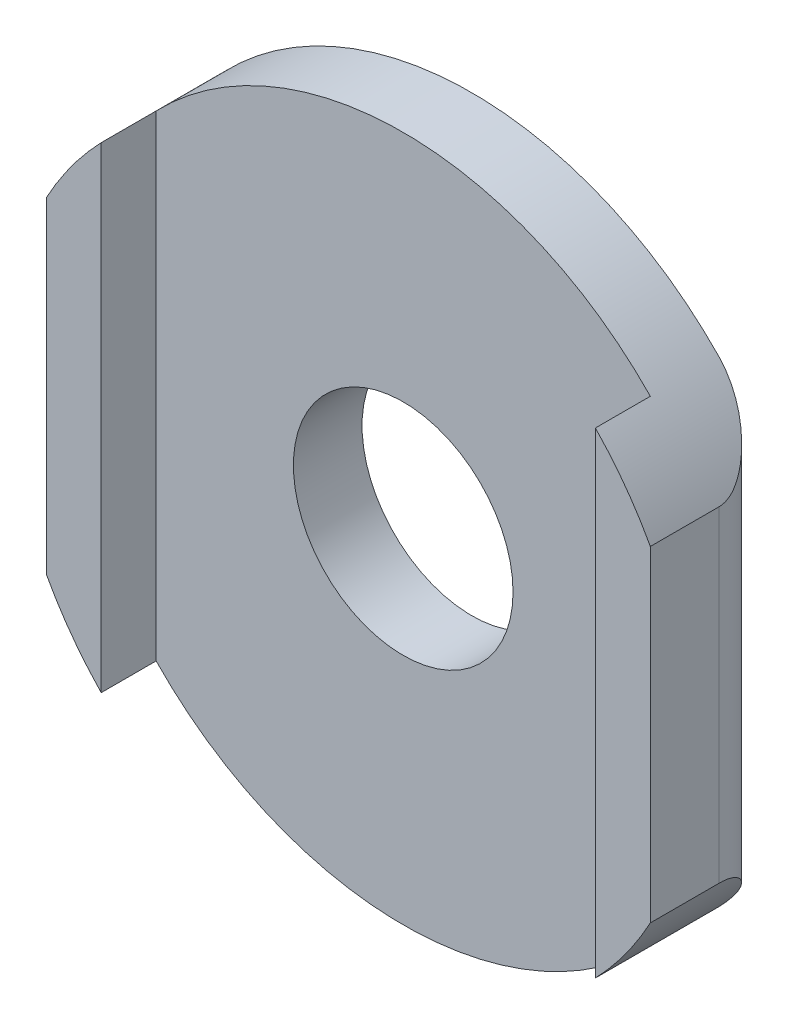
ISO-10303-21;
HEADER;
FILE_DESCRIPTION(('STEP AP214'),'2;1');
FILE_NAME('part.step','',(''),(''),'','','');
FILE_SCHEMA(('AUTOMOTIVE_DESIGN { 1 0 10303 214 1 1 1 1 }'));
ENDSEC;
DATA;
#1=APPLICATION_CONTEXT('core data for automotive mechanical design processes');
#2=APPLICATION_PROTOCOL_DEFINITION('international standard','automotive_design',2000,#1);
#3=PRODUCT_CONTEXT('',#1,'mechanical');
#4=PRODUCT('Part','Part','',(#3));
#5=PRODUCT_RELATED_PRODUCT_CATEGORY('part','',(#4));
#6=PRODUCT_DEFINITION_FORMATION('','',#4);
#7=PRODUCT_DEFINITION_CONTEXT('part definition',#1,'design');
#8=PRODUCT_DEFINITION('design','',#6,#7);
#9=PRODUCT_DEFINITION_SHAPE('','',#8);
#10=(LENGTH_UNIT() NAMED_UNIT(*) SI_UNIT(.MILLI.,.METRE.));
#11=(NAMED_UNIT(*) PLANE_ANGLE_UNIT() SI_UNIT($,.RADIAN.));
#12=(NAMED_UNIT(*) SI_UNIT($,.STERADIAN.) SOLID_ANGLE_UNIT());
#13=UNCERTAINTY_MEASURE_WITH_UNIT(LENGTH_MEASURE(1.E-05),#10,'distance_accuracy_value','');
#14=(GEOMETRIC_REPRESENTATION_CONTEXT(3) GLOBAL_UNCERTAINTY_ASSIGNED_CONTEXT((#13)) GLOBAL_UNIT_ASSIGNED_CONTEXT((#10,
#11,#12)) REPRESENTATION_CONTEXT('',''));
#15=CARTESIAN_POINT('',(0.,0.,0.));
#16=DIRECTION('',(0.,0.,1.));
#17=DIRECTION('',(1.,0.,0.));
#18=AXIS2_PLACEMENT_3D('',#15,#16,#17);
#19=CARTESIAN_POINT('',(0.,0.,2.5));
#20=DIRECTION('',(0.,0.,-1.));
#21=DIRECTION('',(-1.,0.,0.));
#22=AXIS2_PLACEMENT_3D('',#19,#20,#21);
#23=CYLINDRICAL_SURFACE('',#22,12.5);
#24=DIRECTION('',(0.,0.,-1.));
#25=VECTOR('',#24,1.);
#26=CARTESIAN_POINT('',(-11.,-5.93717104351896,4.5));
#27=LINE('',#26,#25);
#28=CARTESIAN_POINT('',(-11.,-5.93717104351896,4.5));
#29=VERTEX_POINT('',#28);
#30=CARTESIAN_POINT('',(-11.,-5.93717104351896,2.));
#31=VERTEX_POINT('',#30);
#32=EDGE_CURVE('E178',#29,#31,#27,.T.);
#33=ORIENTED_EDGE('',*,*,#32,.T.);
#34=CARTESIAN_POINT('',(-11.,-5.93717104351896,2.));
#35=CARTESIAN_POINT('',(-11.0000042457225,-5.93716156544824,1.97048764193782));
#36=CARTESIAN_POINT('',(-10.9993463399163,-5.93838221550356,1.940992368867));
#37=CARTESIAN_POINT('',(-10.9967481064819,-5.94319297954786,1.88228981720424));
#38=CARTESIAN_POINT('',(-10.9948094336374,-5.9467800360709,1.85308221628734));
#39=CARTESIAN_POINT('',(-10.9871989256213,-5.96083681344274,1.76691061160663));
#40=CARTESIAN_POINT('',(-10.9797301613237,-5.97460729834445,1.71061946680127));
#41=CARTESIAN_POINT('',(-10.9579673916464,-6.01444818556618,1.58597203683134));
#42=CARTESIAN_POINT('',(-10.9423513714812,-6.04287687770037,1.51862515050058));
#43=CARTESIAN_POINT('',(-10.9057917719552,-6.10861032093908,1.38968136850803));
#44=CARTESIAN_POINT('',(-10.8848189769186,-6.14596367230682,1.32811862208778));
#45=CARTESIAN_POINT('',(-10.8427000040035,-6.21991593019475,1.22077289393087));
#46=CARTESIAN_POINT('',(-10.8221796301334,-6.25557957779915,1.17407969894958));
#47=CARTESIAN_POINT('',(-10.7788032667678,-6.33002878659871,1.08439161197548));
#48=CARTESIAN_POINT('',(-10.7559456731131,-6.36881648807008,1.04139929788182));
#49=CARTESIAN_POINT('',(-10.6843483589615,-6.48870699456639,0.917352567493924));
#50=CARTESIAN_POINT('',(-10.6326295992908,-6.57325632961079,0.841338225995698));
#51=CARTESIAN_POINT('',(-10.5288272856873,-6.7381240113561,0.708093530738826));
#52=CARTESIAN_POINT('',(-10.4773619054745,-6.81794278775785,0.649726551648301));
#53=CARTESIAN_POINT('',(-10.3700348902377,-6.98010224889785,0.540944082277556));
#54=CARTESIAN_POINT('',(-10.3141701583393,-7.06244468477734,0.490534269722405));
#55=CARTESIAN_POINT('',(-10.1984285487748,-7.22857677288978,0.397095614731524));
#56=CARTESIAN_POINT('',(-10.1385484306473,-7.31236755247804,0.354072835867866));
#57=CARTESIAN_POINT('',(-10.0150759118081,-7.48058434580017,0.275185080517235));
#58=CARTESIAN_POINT('',(-9.95148324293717,-7.56501040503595,0.239320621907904));
#59=CARTESIAN_POINT('',(-9.81879693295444,-7.73649384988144,0.173742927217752));
#60=CARTESIAN_POINT('',(-9.74959425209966,-7.82355229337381,0.144252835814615));
#61=CARTESIAN_POINT('',(-9.6077304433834,-7.99712975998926,0.0930792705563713));
#62=CARTESIAN_POINT('',(-9.53506973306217,-8.08364884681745,0.071394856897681));
#63=CARTESIAN_POINT('',(-9.38692892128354,-8.25519956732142,0.0363155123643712));
#64=CARTESIAN_POINT('',(-9.31146477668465,-8.34023648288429,0.0228795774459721));
#65=CARTESIAN_POINT('',(-9.15773000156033,-8.5087648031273,0.00473370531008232));
#66=CARTESIAN_POINT('',(-9.07945785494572,-8.592255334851,2.85565320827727E-05));
#67=CARTESIAN_POINT('',(-9.,-8.67467578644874,0.));
#68=B_SPLINE_CURVE_WITH_KNOTS('',3,(#34,#35,#36,#37,#38,#39,#40,#41,#42,#43,#44,#45,#46,#47,#48,
#49,#50,#51,#52,#53,#54,#55,#56,#57,#58,#59,#60,#61,#62,#63,#64,#65,#66,#67),.UNSPECIFIED.,.F.,
.F.,(4,2,2,2,2,2,2,2,2,2,2,2,2,2,2,2,4),(0.,0.088473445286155,0.176832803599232,
0.35125128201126,0.57427669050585,0.79854546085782,0.984990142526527,1.17156366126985,
1.54513754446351,1.8791656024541,2.21343093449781,2.54796934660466,2.88253195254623,
3.22738566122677,3.57219783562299,3.91528173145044,4.25855373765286),.UNSPECIFIED.);
#69=CARTESIAN_POINT('',(-9.,-8.67467578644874,0.));
#70=VERTEX_POINT('',#69);
#71=EDGE_CURVE('E41',#31,#70,#68,.T.);
#72=ORIENTED_EDGE('',*,*,#71,.T.);
#73=CARTESIAN_POINT('',(0.,0.,0.));
#74=DIRECTION('',(0.,0.,1.));
#75=DIRECTION('',(1.,0.,0.));
#76=AXIS2_PLACEMENT_3D('',#73,#74,#75);
#77=CIRCLE('',#76,12.5);
#78=CARTESIAN_POINT('',(9.,-8.67467578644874,0.));
#79=VERTEX_POINT('',#78);
#80=EDGE_CURVE('E192',#70,#79,#77,.T.);
#81=ORIENTED_EDGE('',*,*,#80,.T.);
#82=CARTESIAN_POINT('',(9.,-8.67467578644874,0.));
#83=CARTESIAN_POINT('',(9.08358594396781,-8.58797597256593,3.51766017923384E-05));
#84=CARTESIAN_POINT('',(9.16585430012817,-8.5000944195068,0.00523806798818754));
#85=CARTESIAN_POINT('',(9.32726101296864,-8.32264870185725,0.0252736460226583));
#86=CARTESIAN_POINT('',(9.4064010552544,-8.23308548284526,0.0401010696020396));
#87=CARTESIAN_POINT('',(9.56235094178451,-8.05146093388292,0.0789813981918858));
#88=CARTESIAN_POINT('',(9.63910546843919,-7.95938241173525,0.103174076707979));
#89=CARTESIAN_POINT('',(9.78865852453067,-7.77472023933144,0.16031819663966));
#90=CARTESIAN_POINT('',(9.8614566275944,-7.68213653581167,0.193270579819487));
#91=CARTESIAN_POINT('',(10.0042766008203,-7.49523639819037,0.268503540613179));
#92=CARTESIAN_POINT('',(10.0742091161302,-7.4009240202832,0.310964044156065));
#93=CARTESIAN_POINT('',(10.2093681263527,-7.21333252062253,0.404941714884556));
#94=CARTESIAN_POINT('',(10.274592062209,-7.12005398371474,0.456463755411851));
#95=CARTESIAN_POINT('',(10.3994100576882,-6.93646183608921,0.568689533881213));
#96=CARTESIAN_POINT('',(10.4590411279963,-6.84613176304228,0.629324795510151));
#97=CARTESIAN_POINT('',(10.572454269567,-6.66964425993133,0.761070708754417));
#98=CARTESIAN_POINT('',(10.6262456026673,-6.58348034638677,0.832164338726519));
#99=CARTESIAN_POINT('',(10.7108163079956,-6.44459359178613,0.962187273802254));
#100=CARTESIAN_POINT('',(10.7434795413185,-6.38993894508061,1.01781226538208));
#101=CARTESIAN_POINT('',(10.8048825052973,-6.28555288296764,1.13580564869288));
#102=CARTESIAN_POINT('',(10.8336149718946,-6.23583062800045,1.19818615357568));
#103=CARTESIAN_POINT('',(10.8863437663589,-6.14332091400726,1.33147087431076));
#104=CARTESIAN_POINT('',(10.9102603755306,-6.10065199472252,1.40249152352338));
#105=CARTESIAN_POINT('',(10.9507610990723,-6.02765126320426,1.55227445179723));
#106=CARTESIAN_POINT('',(10.9673952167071,-5.99723543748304,1.63097924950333));
#107=CARTESIAN_POINT('',(10.9859745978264,-5.96310101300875,1.7589791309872));
#108=CARTESIAN_POINT('',(10.991161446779,-5.95352511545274,1.80624880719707));
#109=CARTESIAN_POINT('',(10.998206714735,-5.94049385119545,1.90230222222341));
#110=CARTESIAN_POINT('',(11.0000338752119,-5.93709596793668,1.95109592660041));
#111=CARTESIAN_POINT('',(11.,-5.93717104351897,2.));
#112=B_SPLINE_CURVE_WITH_KNOTS('',3,(#82,#83,#84,#85,#86,#87,#88,#89,#90,#91,#92,#93,#94,#95,
#96,#97,#98,#99,#100,#101,#102,#103,#104,#105,#106,#107,#108,#109,#110,#111),.UNSPECIFIED.,.F.,
.F.,(4,2,2,2,2,2,2,2,2,2,2,2,2,2,4),(0.,0.361076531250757,0.721955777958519,1.08844268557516,
1.4549690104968,1.82912626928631,2.20348537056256,2.57516051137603,2.946237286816,
3.199499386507,3.45322336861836,3.71085325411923,3.96668533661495,4.11171882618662,
4.25809500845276),.UNSPECIFIED.);
#113=CARTESIAN_POINT('',(11.,-5.93717104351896,2.));
#114=VERTEX_POINT('',#113);
#115=EDGE_CURVE('E48',#79,#114,#112,.T.);
#116=ORIENTED_EDGE('',*,*,#115,.T.);
#117=DIRECTION('',(0.,0.,-1.));
#118=VECTOR('',#117,1.);
#119=CARTESIAN_POINT('',(11.,-5.93717104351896,4.5));
#120=LINE('',#119,#118);
#121=CARTESIAN_POINT('',(11.,-5.93717104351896,4.5));
#122=VERTEX_POINT('',#121);
#123=EDGE_CURVE('E149',#122,#114,#120,.T.);
#124=ORIENTED_EDGE('',*,*,#123,.F.);
#125=CARTESIAN_POINT('',(0.,0.,4.5));
#126=DIRECTION('',(0.,0.,-1.));
#127=DIRECTION('',(-1.,0.,0.));
#128=AXIS2_PLACEMENT_3D('',#125,#126,#127);
#129=CIRCLE('',#128,12.5);
#130=CARTESIAN_POINT('',(9.,-8.67467578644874,4.5));
#131=VERTEX_POINT('',#130);
#132=EDGE_CURVE('E139',#122,#131,#129,.T.);
#133=ORIENTED_EDGE('',*,*,#132,.T.);
#134=DIRECTION('',(0.,0.,-1.));
#135=VECTOR('',#134,1.);
#136=CARTESIAN_POINT('',(9.,-8.67467578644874,4.5));
#137=LINE('',#136,#135);
#138=CARTESIAN_POINT('',(9.,-8.67467578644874,2.5));
#139=VERTEX_POINT('',#138);
#140=EDGE_CURVE('E125',#131,#139,#137,.T.);
#141=ORIENTED_EDGE('',*,*,#140,.T.);
#142=CARTESIAN_POINT('',(0.,0.,2.5));
#143=DIRECTION('',(0.,0.,1.));
#144=DIRECTION('',(1.,0.,0.));
#145=AXIS2_PLACEMENT_3D('',#142,#143,#144);
#146=CIRCLE('',#145,12.5);
#147=CARTESIAN_POINT('',(-9.,-8.67467578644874,2.5));
#148=VERTEX_POINT('',#147);
#149=EDGE_CURVE('E182',#148,#139,#146,.T.);
#150=ORIENTED_EDGE('',*,*,#149,.F.);
#151=DIRECTION('',(0.,0.,-1.));
#152=VECTOR('',#151,1.);
#153=CARTESIAN_POINT('',(-9.,-8.67467578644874,4.5));
#154=LINE('',#153,#152);
#155=CARTESIAN_POINT('',(-9.,-8.67467578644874,4.5));
#156=VERTEX_POINT('',#155);
#157=EDGE_CURVE('E173',#156,#148,#154,.T.);
#158=ORIENTED_EDGE('',*,*,#157,.F.);
#159=CARTESIAN_POINT('',(0.,0.,4.5));
#160=DIRECTION('',(0.,0.,1.));
#161=DIRECTION('',(1.,0.,0.));
#162=AXIS2_PLACEMENT_3D('',#159,#160,#161);
#163=CIRCLE('',#162,12.5);
#164=EDGE_CURVE('E157',#29,#156,#163,.T.);
#165=ORIENTED_EDGE('',*,*,#164,.F.);
#166=EDGE_LOOP('',(#33,#72,#81,#116,#124,#133,#141,#150,#158,#165));
#167=FACE_BOUND('',#166,.T.);
#168=ADVANCED_FACE('F32',(#167),#23,.T.);
#169=CARTESIAN_POINT('',(0.,0.,2.5));
#170=DIRECTION('',(0.,0.,1.));
#171=DIRECTION('',(1.,0.,0.));
#172=AXIS2_PLACEMENT_3D('',#169,#170,#171);
#173=PLANE('',#172);
#174=CARTESIAN_POINT('',(0.,0.,2.5));
#175=DIRECTION('',(0.,0.,1.));
#176=DIRECTION('',(1.,0.,0.));
#177=AXIS2_PLACEMENT_3D('',#174,#175,#176);
#178=CIRCLE('',#177,4.);
#179=CARTESIAN_POINT('',(4.,0.,2.5));
#180=VERTEX_POINT('',#179);
#181=EDGE_CURVE('E384',#180,#180,#178,.T.);
#182=ORIENTED_EDGE('',*,*,#181,.F.);
#183=EDGE_LOOP('',(#182));
#184=FACE_BOUND('',#183,.T.);
#185=DIRECTION('',(0.,1.,0.));
#186=VECTOR('',#185,1.);
#187=CARTESIAN_POINT('',(9.,8.67467578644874,2.5));
#188=LINE('',#187,#186);
#189=CARTESIAN_POINT('',(9.,8.67467578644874,2.5));
#190=VERTEX_POINT('',#189);
#191=EDGE_CURVE('E135',#139,#190,#188,.T.);
#192=ORIENTED_EDGE('',*,*,#191,.T.);
#193=CARTESIAN_POINT('',(-9.,8.67467578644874,2.5));
#194=VERTEX_POINT('',#193);
#195=EDGE_CURVE('E120',#190,#194,#146,.T.);
#196=ORIENTED_EDGE('',*,*,#195,.T.);
#197=DIRECTION('',(0.,1.,0.));
#198=VECTOR('',#197,1.);
#199=CARTESIAN_POINT('',(-9.,8.67467578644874,2.5));
#200=LINE('',#199,#198);
#201=EDGE_CURVE('E124',#148,#194,#200,.T.);
#202=ORIENTED_EDGE('',*,*,#201,.F.);
#203=ORIENTED_EDGE('',*,*,#149,.T.);
#204=EDGE_LOOP('',(#192,#196,#202,#203));
#205=FACE_BOUND('',#204,.T.);
#206=ADVANCED_FACE('F223',(#184,#205),#173,.T.);
#207=CARTESIAN_POINT('',(9.,8.67467578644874,0.));
#208=VERTEX_POINT('',#207);
#209=CARTESIAN_POINT('',(-9.,8.67467578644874,0.));
#210=VERTEX_POINT('',#209);
#211=EDGE_CURVE('E164',#208,#210,#77,.T.);
#212=ORIENTED_EDGE('',*,*,#211,.T.);
#213=CARTESIAN_POINT('',(-9.,8.67467578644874,0.));
#214=CARTESIAN_POINT('',(-9.08358594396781,8.58797597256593,3.51766017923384E-05));
#215=CARTESIAN_POINT('',(-9.16585430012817,8.5000944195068,0.00523806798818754));
#216=CARTESIAN_POINT('',(-9.32726101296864,8.32264870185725,0.0252736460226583));
#217=CARTESIAN_POINT('',(-9.4064010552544,8.23308548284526,0.0401010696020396));
#218=CARTESIAN_POINT('',(-9.56235094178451,8.05146093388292,0.0789813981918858));
#219=CARTESIAN_POINT('',(-9.63910546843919,7.95938241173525,0.103174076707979));
#220=CARTESIAN_POINT('',(-9.78865852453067,7.77472023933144,0.16031819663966));
#221=CARTESIAN_POINT('',(-9.8614566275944,7.68213653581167,0.193270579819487));
#222=CARTESIAN_POINT('',(-10.0042766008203,7.49523639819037,0.268503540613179));
#223=CARTESIAN_POINT('',(-10.0742091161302,7.4009240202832,0.310964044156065));
#224=CARTESIAN_POINT('',(-10.2093681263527,7.21333252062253,0.404941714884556));
#225=CARTESIAN_POINT('',(-10.274592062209,7.12005398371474,0.456463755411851));
#226=CARTESIAN_POINT('',(-10.3994100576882,6.93646183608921,0.568689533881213));
#227=CARTESIAN_POINT('',(-10.4590411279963,6.84613176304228,0.629324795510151));
#228=CARTESIAN_POINT('',(-10.572454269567,6.66964425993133,0.761070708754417));
#229=CARTESIAN_POINT('',(-10.6262456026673,6.58348034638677,0.832164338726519));
#230=CARTESIAN_POINT('',(-10.7108163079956,6.44459359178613,0.962187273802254));
#231=CARTESIAN_POINT('',(-10.7434795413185,6.38993894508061,1.01781226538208));
#232=CARTESIAN_POINT('',(-10.8048825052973,6.28555288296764,1.13580564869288));
#233=CARTESIAN_POINT('',(-10.8336149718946,6.23583062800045,1.19818615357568));
#234=CARTESIAN_POINT('',(-10.8863437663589,6.14332091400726,1.33147087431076));
#235=CARTESIAN_POINT('',(-10.9102603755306,6.10065199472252,1.40249152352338));
#236=CARTESIAN_POINT('',(-10.9507610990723,6.02765126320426,1.55227445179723));
#237=CARTESIAN_POINT('',(-10.9673952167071,5.99723543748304,1.63097924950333));
#238=CARTESIAN_POINT('',(-10.9859745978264,5.96310101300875,1.7589791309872));
#239=CARTESIAN_POINT('',(-10.991161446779,5.95352511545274,1.80624880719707));
#240=CARTESIAN_POINT('',(-10.998206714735,5.94049385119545,1.90230222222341));
#241=CARTESIAN_POINT('',(-11.0000338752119,5.93709596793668,1.95109592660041));
#242=CARTESIAN_POINT('',(-11.,5.93717104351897,2.));
#243=B_SPLINE_CURVE_WITH_KNOTS('',3,(#213,#214,#215,#216,#217,#218,#219,#220,#221,#222,#223,
#224,#225,#226,#227,#228,#229,#230,#231,#232,#233,#234,#235,#236,#237,#238,#239,#240,#241,#242),
.UNSPECIFIED.,.F.,.F.,(4,2,2,2,2,2,2,2,2,2,2,2,2,2,4),(0.,0.361076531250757,0.721955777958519,
1.08844268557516,1.4549690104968,1.82912626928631,2.20348537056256,2.57516051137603,
2.946237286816,3.199499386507,3.45322336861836,3.71085325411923,3.96668533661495,
4.11171882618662,4.25809500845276),.UNSPECIFIED.);
#244=CARTESIAN_POINT('',(-11.,5.93717104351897,2.));
#245=VERTEX_POINT('',#244);
#246=EDGE_CURVE('E196',#210,#245,#243,.T.);
#247=ORIENTED_EDGE('',*,*,#246,.T.);
#248=DIRECTION('',(0.,0.,-1.));
#249=VECTOR('',#248,1.);
#250=CARTESIAN_POINT('',(-11.,5.93717104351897,4.5));
#251=LINE('',#250,#249);
#252=CARTESIAN_POINT('',(-11.,5.93717104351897,4.5));
#253=VERTEX_POINT('',#252);
#254=EDGE_CURVE('E190',#253,#245,#251,.T.);
#255=ORIENTED_EDGE('',*,*,#254,.F.);
#256=CARTESIAN_POINT('',(0.,0.,4.5));
#257=DIRECTION('',(0.,0.,1.));
#258=DIRECTION('',(1.,0.,0.));
#259=AXIS2_PLACEMENT_3D('',#256,#257,#258);
#260=CIRCLE('',#259,12.5);
#261=CARTESIAN_POINT('',(-9.,8.67467578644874,4.5));
#262=VERTEX_POINT('',#261);
#263=EDGE_CURVE('E152',#262,#253,#260,.T.);
#264=ORIENTED_EDGE('',*,*,#263,.F.);
#265=DIRECTION('',(0.,0.,-1.));
#266=VECTOR('',#265,1.);
#267=CARTESIAN_POINT('',(-9.,8.67467578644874,4.5));
#268=LINE('',#267,#266);
#269=EDGE_CURVE('E161',#262,#194,#268,.T.);
#270=ORIENTED_EDGE('',*,*,#269,.T.);
#271=ORIENTED_EDGE('',*,*,#195,.F.);
#272=DIRECTION('',(0.,0.,-1.));
#273=VECTOR('',#272,1.);
#274=CARTESIAN_POINT('',(9.,8.67467578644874,4.5));
#275=LINE('',#274,#273);
#276=CARTESIAN_POINT('',(9.,8.67467578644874,4.5));
#277=VERTEX_POINT('',#276);
#278=EDGE_CURVE('E112',#277,#190,#275,.T.);
#279=ORIENTED_EDGE('',*,*,#278,.F.);
#280=CARTESIAN_POINT('',(0.,0.,4.5));
#281=DIRECTION('',(0.,0.,-1.));
#282=DIRECTION('',(-1.,0.,0.));
#283=AXIS2_PLACEMENT_3D('',#280,#281,#282);
#284=CIRCLE('',#283,12.5);
#285=CARTESIAN_POINT('',(11.,5.93717104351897,4.5));
#286=VERTEX_POINT('',#285);
#287=EDGE_CURVE('E117',#277,#286,#284,.T.);
#288=ORIENTED_EDGE('',*,*,#287,.T.);
#289=DIRECTION('',(0.,0.,-1.));
#290=VECTOR('',#289,1.);
#291=CARTESIAN_POINT('',(11.,5.93717104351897,4.5));
#292=LINE('',#291,#290);
#293=CARTESIAN_POINT('',(11.,5.93717104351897,2.));
#294=VERTEX_POINT('',#293);
#295=EDGE_CURVE('E145',#286,#294,#292,.T.);
#296=ORIENTED_EDGE('',*,*,#295,.T.);
#297=CARTESIAN_POINT('',(11.,5.93717104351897,2.));
#298=CARTESIAN_POINT('',(11.0000042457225,5.93716156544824,1.97048764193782));
#299=CARTESIAN_POINT('',(10.9993463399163,5.93838221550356,1.940992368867));
#300=CARTESIAN_POINT('',(10.9967481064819,5.94319297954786,1.88228981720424));
#301=CARTESIAN_POINT('',(10.9948094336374,5.9467800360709,1.85308221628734));
#302=CARTESIAN_POINT('',(10.9871989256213,5.96083681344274,1.76691061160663));
#303=CARTESIAN_POINT('',(10.9797301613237,5.97460729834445,1.71061946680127));
#304=CARTESIAN_POINT('',(10.9579673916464,6.01444818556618,1.58597203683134));
#305=CARTESIAN_POINT('',(10.9423513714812,6.04287687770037,1.51862515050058));
#306=CARTESIAN_POINT('',(10.9057917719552,6.10861032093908,1.38968136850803));
#307=CARTESIAN_POINT('',(10.8848189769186,6.14596367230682,1.32811862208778));
#308=CARTESIAN_POINT('',(10.8427000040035,6.21991593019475,1.22077289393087));
#309=CARTESIAN_POINT('',(10.8221796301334,6.25557957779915,1.17407969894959));
#310=CARTESIAN_POINT('',(10.7788032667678,6.33002878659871,1.08439161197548));
#311=CARTESIAN_POINT('',(10.7559456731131,6.36881648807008,1.04139929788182));
#312=CARTESIAN_POINT('',(10.6843483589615,6.48870699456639,0.917352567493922));
#313=CARTESIAN_POINT('',(10.6326295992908,6.57325632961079,0.841338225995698));
#314=CARTESIAN_POINT('',(10.5288272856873,6.73812401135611,0.708093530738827));
#315=CARTESIAN_POINT('',(10.4773619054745,6.81794278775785,0.649726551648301));
#316=CARTESIAN_POINT('',(10.3700348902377,6.98010224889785,0.540944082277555));
#317=CARTESIAN_POINT('',(10.3141701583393,7.06244468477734,0.490534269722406));
#318=CARTESIAN_POINT('',(10.1984285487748,7.22857677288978,0.397095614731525));
#319=CARTESIAN_POINT('',(10.1385484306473,7.31236755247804,0.354072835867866));
#320=CARTESIAN_POINT('',(10.0150759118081,7.48058434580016,0.275185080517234));
#321=CARTESIAN_POINT('',(9.95148324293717,7.56501040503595,0.239320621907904));
#322=CARTESIAN_POINT('',(9.81879693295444,7.73649384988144,0.173742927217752));
#323=CARTESIAN_POINT('',(9.74959425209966,7.82355229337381,0.144252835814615));
#324=CARTESIAN_POINT('',(9.6077304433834,7.99712975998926,0.0930792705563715));
#325=CARTESIAN_POINT('',(9.53506973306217,8.08364884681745,0.0713948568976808));
#326=CARTESIAN_POINT('',(9.38692892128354,8.25519956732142,0.0363155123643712));
#327=CARTESIAN_POINT('',(9.31146477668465,8.34023648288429,0.0228795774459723));
#328=CARTESIAN_POINT('',(9.15773000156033,8.5087648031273,0.00473370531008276));
#329=CARTESIAN_POINT('',(9.07945785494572,8.592255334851,2.85565320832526E-05));
#330=CARTESIAN_POINT('',(9.,8.67467578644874,0.));
#331=B_SPLINE_CURVE_WITH_KNOTS('',3,(#297,#298,#299,#300,#301,#302,#303,#304,#305,#306,#307,
#308,#309,#310,#311,#312,#313,#314,#315,#316,#317,#318,#319,#320,#321,#322,#323,#324,#325,#326,
#327,#328,#329,#330),.UNSPECIFIED.,.F.,.F.,(4,2,2,2,2,2,2,2,2,2,2,2,2,2,2,2,4),(0.,
0.0884734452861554,0.176832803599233,0.351251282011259,0.574276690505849,0.79854546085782,
0.984990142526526,1.17156366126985,1.54513754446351,1.8791656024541,2.21343093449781,
2.54796934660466,2.88253195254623,3.22738566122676,3.57219783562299,3.91528173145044,
4.25855373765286),.UNSPECIFIED.);
#332=EDGE_CURVE('E198',#294,#208,#331,.T.);
#333=ORIENTED_EDGE('',*,*,#332,.T.);
#334=EDGE_LOOP('',(#212,#247,#255,#264,#270,#271,#279,#288,#296,#333));
#335=FACE_BOUND('',#334,.T.);
#336=ADVANCED_FACE('F115',(#335),#23,.T.);
#337=CARTESIAN_POINT('',(0.,0.,0.));
#338=DIRECTION('',(0.,0.,1.));
#339=DIRECTION('',(1.,0.,0.));
#340=AXIS2_PLACEMENT_3D('',#337,#338,#339);
#341=PLANE('',#340);
#342=CARTESIAN_POINT('',(0.,0.,0.));
#343=DIRECTION('',(0.,0.,1.));
#344=DIRECTION('',(1.,0.,0.));
#345=AXIS2_PLACEMENT_3D('',#342,#343,#344);
#346=CIRCLE('',#345,4.);
#347=CARTESIAN_POINT('',(4.,0.,0.));
#348=VERTEX_POINT('',#347);
#349=EDGE_CURVE('E147',#348,#348,#346,.T.);
#350=ORIENTED_EDGE('',*,*,#349,.T.);
#351=EDGE_LOOP('',(#350));
#352=FACE_BOUND('',#351,.T.);
#353=ORIENTED_EDGE('',*,*,#80,.F.);
#354=DIRECTION('',(0.,1.,0.));
#355=VECTOR('',#354,1.);
#356=CARTESIAN_POINT('',(-9.,0.,0.));
#357=LINE('',#356,#355);
#358=EDGE_CURVE('E205',#70,#210,#357,.T.);
#359=ORIENTED_EDGE('',*,*,#358,.T.);
#360=ORIENTED_EDGE('',*,*,#211,.F.);
#361=DIRECTION('',(0.,-1.,0.));
#362=VECTOR('',#361,1.);
#363=CARTESIAN_POINT('',(9.,-5.93717104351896,0.));
#364=LINE('',#363,#362);
#365=EDGE_CURVE('E183',#208,#79,#364,.T.);
#366=ORIENTED_EDGE('',*,*,#365,.T.);
#367=EDGE_LOOP('',(#353,#359,#360,#366));
#368=FACE_BOUND('',#367,.T.);
#369=ADVANCED_FACE('F203',(#352,#368),#341,.F.);
#370=CARTESIAN_POINT('',(-11.,5.93717104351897,4.5));
#371=DIRECTION('',(1.,0.,0.));
#372=DIRECTION('',(0.,0.,-1.));
#373=AXIS2_PLACEMENT_3D('',#370,#371,#372);
#374=PLANE('',#373);
#375=ORIENTED_EDGE('',*,*,#254,.T.);
#376=DIRECTION('',(0.,1.,0.));
#377=VECTOR('',#376,1.);
#378=CARTESIAN_POINT('',(-11.,5.93717104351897,2.));
#379=LINE('',#378,#377);
#380=EDGE_CURVE('E56',#245,#31,#379,.F.);
#381=ORIENTED_EDGE('',*,*,#380,.T.);
#382=ORIENTED_EDGE('',*,*,#32,.F.);
#383=DIRECTION('',(0.,-1.,0.));
#384=VECTOR('',#383,1.);
#385=CARTESIAN_POINT('',(-11.,5.93717104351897,4.5));
#386=LINE('',#385,#384);
#387=EDGE_CURVE('E155',#253,#29,#386,.T.);
#388=ORIENTED_EDGE('',*,*,#387,.F.);
#389=EDGE_LOOP('',(#375,#381,#382,#388));
#390=FACE_BOUND('',#389,.T.);
#391=ADVANCED_FACE('F260',(#390),#374,.F.);
#392=CARTESIAN_POINT('',(-9.,8.67467578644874,4.5));
#393=DIRECTION('',(-1.,0.,0.));
#394=DIRECTION('',(0.,0.,1.));
#395=AXIS2_PLACEMENT_3D('',#392,#393,#394);
#396=PLANE('',#395);
#397=ORIENTED_EDGE('',*,*,#201,.T.);
#398=ORIENTED_EDGE('',*,*,#269,.F.);
#399=DIRECTION('',(0.,1.,0.));
#400=VECTOR('',#399,1.);
#401=CARTESIAN_POINT('',(-9.,8.67467578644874,4.5));
#402=LINE('',#401,#400);
#403=EDGE_CURVE('E159',#156,#262,#402,.T.);
#404=ORIENTED_EDGE('',*,*,#403,.F.);
#405=ORIENTED_EDGE('',*,*,#157,.T.);
#406=EDGE_LOOP('',(#397,#398,#404,#405));
#407=FACE_BOUND('',#406,.T.);
#408=ADVANCED_FACE('F263',(#407),#396,.F.);
#409=CARTESIAN_POINT('',(0.,0.,4.5));
#410=DIRECTION('',(0.,0.,1.));
#411=DIRECTION('',(1.,0.,0.));
#412=AXIS2_PLACEMENT_3D('',#409,#410,#411);
#413=PLANE('',#412);
#414=ORIENTED_EDGE('',*,*,#263,.T.);
#415=ORIENTED_EDGE('',*,*,#387,.T.);
#416=ORIENTED_EDGE('',*,*,#164,.T.);
#417=ORIENTED_EDGE('',*,*,#403,.T.);
#418=EDGE_LOOP('',(#414,#415,#416,#417));
#419=FACE_BOUND('',#418,.T.);
#420=ADVANCED_FACE('F266',(#419),#413,.T.);
#421=CARTESIAN_POINT('',(9.,8.67467578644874,4.5));
#422=DIRECTION('',(-1.,0.,0.));
#423=DIRECTION('',(0.,0.,1.));
#424=AXIS2_PLACEMENT_3D('',#421,#422,#423);
#425=PLANE('',#424);
#426=ORIENTED_EDGE('',*,*,#191,.F.);
#427=ORIENTED_EDGE('',*,*,#140,.F.);
#428=DIRECTION('',(0.,1.,0.));
#429=VECTOR('',#428,1.);
#430=CARTESIAN_POINT('',(9.,8.67467578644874,4.5));
#431=LINE('',#430,#429);
#432=EDGE_CURVE('E131',#131,#277,#431,.T.);
#433=ORIENTED_EDGE('',*,*,#432,.T.);
#434=ORIENTED_EDGE('',*,*,#278,.T.);
#435=EDGE_LOOP('',(#426,#427,#433,#434));
#436=FACE_BOUND('',#435,.T.);
#437=ADVANCED_FACE('F137',(#436),#425,.T.);
#438=CARTESIAN_POINT('',(11.,5.93717104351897,4.5));
#439=DIRECTION('',(1.,0.,0.));
#440=DIRECTION('',(0.,0.,-1.));
#441=AXIS2_PLACEMENT_3D('',#438,#439,#440);
#442=PLANE('',#441);
#443=ORIENTED_EDGE('',*,*,#123,.T.);
#444=DIRECTION('',(0.,-1.,0.));
#445=VECTOR('',#444,1.);
#446=CARTESIAN_POINT('',(11.,5.93717104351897,2.));
#447=LINE('',#446,#445);
#448=EDGE_CURVE('E11',#114,#294,#447,.F.);
#449=ORIENTED_EDGE('',*,*,#448,.T.);
#450=ORIENTED_EDGE('',*,*,#295,.F.);
#451=DIRECTION('',(0.,-1.,0.));
#452=VECTOR('',#451,1.);
#453=CARTESIAN_POINT('',(11.,5.93717104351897,4.5));
#454=LINE('',#453,#452);
#455=EDGE_CURVE('E134',#286,#122,#454,.T.);
#456=ORIENTED_EDGE('',*,*,#455,.T.);
#457=EDGE_LOOP('',(#443,#449,#450,#456));
#458=FACE_BOUND('',#457,.T.);
#459=ADVANCED_FACE('F273',(#458),#442,.T.);
#460=CARTESIAN_POINT('',(0.,0.,4.5));
#461=DIRECTION('',(0.,0.,1.));
#462=DIRECTION('',(-1.,0.,0.));
#463=AXIS2_PLACEMENT_3D('',#460,#461,#462);
#464=PLANE('',#463);
#465=ORIENTED_EDGE('',*,*,#287,.F.);
#466=ORIENTED_EDGE('',*,*,#432,.F.);
#467=ORIENTED_EDGE('',*,*,#132,.F.);
#468=ORIENTED_EDGE('',*,*,#455,.F.);
#469=EDGE_LOOP('',(#465,#466,#467,#468));
#470=FACE_BOUND('',#469,.T.);
#471=ADVANCED_FACE('F129',(#470),#464,.T.);
#472=CARTESIAN_POINT('',(0.,0.,0.));
#473=DIRECTION('',(0.,0.,1.));
#474=DIRECTION('',(1.,0.,0.));
#475=AXIS2_PLACEMENT_3D('',#472,#473,#474);
#476=CYLINDRICAL_SURFACE('',#475,4.);
#477=ORIENTED_EDGE('',*,*,#349,.F.);
#478=EDGE_LOOP('',(#477));
#479=FACE_BOUND('',#478,.T.);
#480=ORIENTED_EDGE('',*,*,#181,.T.);
#481=EDGE_LOOP('',(#480));
#482=FACE_BOUND('',#481,.T.);
#483=ADVANCED_FACE('F243',(#479,#482),#476,.F.);
#484=CARTESIAN_POINT('',(-9.,0.,2.));
#485=DIRECTION('',(0.,1.,0.));
#486=DIRECTION('',(0.,0.,1.));
#487=AXIS2_PLACEMENT_3D('',#484,#485,#486);
#488=CYLINDRICAL_SURFACE('',#487,2.);
#489=ORIENTED_EDGE('',*,*,#71,.F.);
#490=ORIENTED_EDGE('',*,*,#380,.F.);
#491=ORIENTED_EDGE('',*,*,#246,.F.);
#492=ORIENTED_EDGE('',*,*,#358,.F.);
#493=EDGE_LOOP('',(#489,#490,#491,#492));
#494=FACE_BOUND('',#493,.T.);
#495=ADVANCED_FACE('F225',(#494),#488,.T.);
#496=CARTESIAN_POINT('',(9.,0.,2.));
#497=DIRECTION('',(0.,1.,0.));
#498=DIRECTION('',(0.,0.,1.));
#499=AXIS2_PLACEMENT_3D('',#496,#497,#498);
#500=CYLINDRICAL_SURFACE('',#499,2.);
#501=ORIENTED_EDGE('',*,*,#332,.F.);
#502=ORIENTED_EDGE('',*,*,#448,.F.);
#503=ORIENTED_EDGE('',*,*,#115,.F.);
#504=ORIENTED_EDGE('',*,*,#365,.F.);
#505=EDGE_LOOP('',(#501,#502,#503,#504));
#506=FACE_BOUND('',#505,.T.);
#507=ADVANCED_FACE('F34',(#506),#500,.T.);
#508=CLOSED_SHELL('',(#168,#206,#336,#369,#391,#408,#420,#437,#459,#471,#483,#495,#507));
#509=MANIFOLD_SOLID_BREP('B2',#508);
#510=ADVANCED_BREP_SHAPE_REPRESENTATION('',(#18,#509),#14);
#511=SHAPE_DEFINITION_REPRESENTATION(#9,#510);
ENDSEC;
END-ISO-10303-21;
